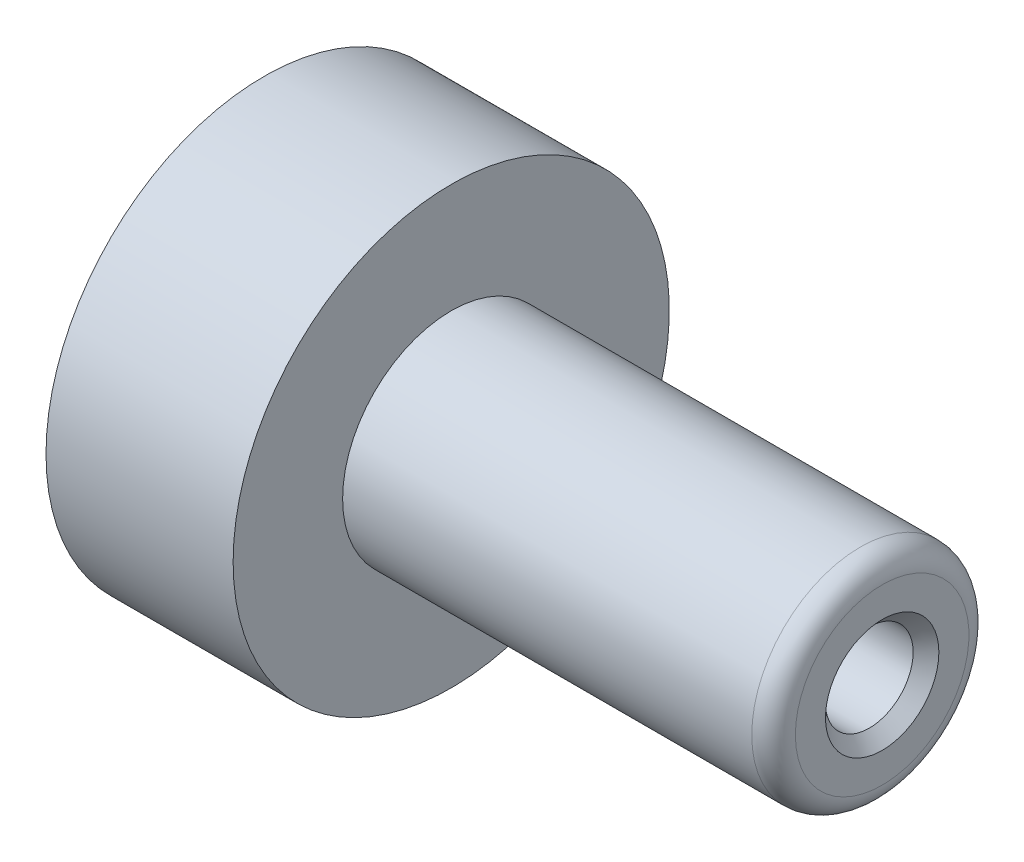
from build123d import *

# Parameters (mm, degrees)
SKETCH2_R          = 1.6129
CUT_EXTRUDE1_DEPTH = 6.35
SKETCH3_R          = 2.5527
CUT_EXTRUDE2_DEPTH = 41.224242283
CHAMFER1_SIZE      = 0.7493


with BuildPart() as part:
    # Sketch1 → Revolve1 (revolve)
    with BuildSketch(Plane.XY, mode=Mode.PRIVATE) as revolve1_sk:
        with BuildLine():
            Line((0, 3.9751), (0, 12.7))
            Line((0, 12.7), (10.8966, 12.7))
            Line((10.8966, 12.7), (10.8966, 6.3246))
            Line((10.8966, 6.3246), (34.7218, 6.3246))
            ThreePointArc((34.7218, 6.3246), (35.619825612, 5.952625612), (35.9918, 5.0546))
            Line((35.9918, 5.0546), (35.9918, 0))
            Line((35.9918, 0), (21.8948, 0))
            Line((21.8948, 0), (21.8948, 3.9751))
            Line((21.8948, 3.9751), (0, 3.9751))
        make_face()
    revolve(revolve1_sk.sketch.rotate(Axis((0, 0, 0), (1, 0, 0)), 90), axis=Axis((0, 0, 0), (1, 0, 0)))

    # Sketch2 → Cut-Extrude1 (cut)
    with BuildSketch(Plane.ZY):
        with Locations((-7.1374, 0)):
            Circle(SKETCH2_R)
        with Locations(Location((7.1374, 0, 0), (0, 0, 180))):
            Circle(SKETCH2_R)
    extrude(amount=-CUT_EXTRUDE1_DEPTH, mode=Mode.SUBTRACT)

    # Sketch3 → Cut-Extrude2 (cut, through all)
    with BuildSketch(Plane(origin=(35.9918, 0, 0), x_dir=(0, 0, -1), z_dir=(1, 0, 0))):
        Circle(SKETCH3_R)
    extrude(amount=-CUT_EXTRUDE2_DEPTH, mode=Mode.SUBTRACT)

    # Chamfer1
    chamfer1_edges = [part.edges().sort_by_distance(p)[0] for p in [
        (35.9918, 0, 2.5527),
    ]]
    chamfer(chamfer1_edges, length=CHAMFER1_SIZE)


solid = part.part
